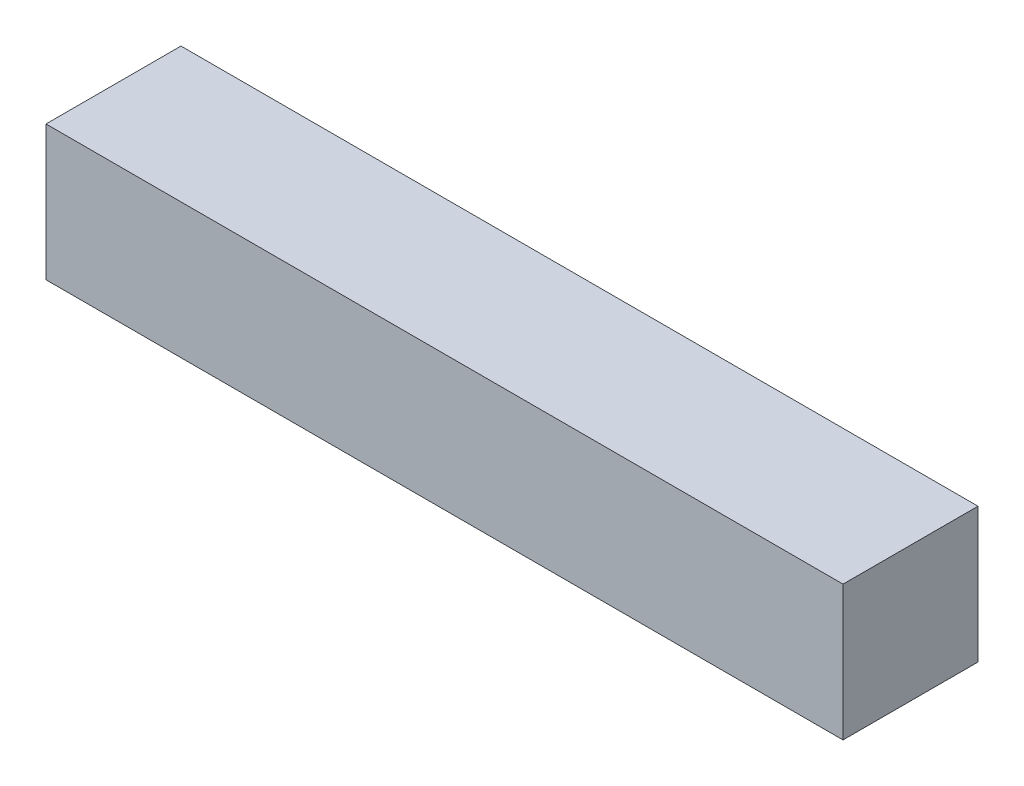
from build123d import *

# Parameters (mm, degrees)
SKETCH1_W            = 12.7
SKETCH1_H            = 12.7
PANEL_OR_BLOCK_DEPTH = 75


with BuildPart() as part:
    # Sketch1 → Panel_or_block (new body)
    with BuildSketch(Plane.YZ):
        with Locations((0, -6.35)):
            Rectangle(SKETCH1_W, SKETCH1_H)
    extrude(amount=PANEL_OR_BLOCK_DEPTH)


solid = part.part
